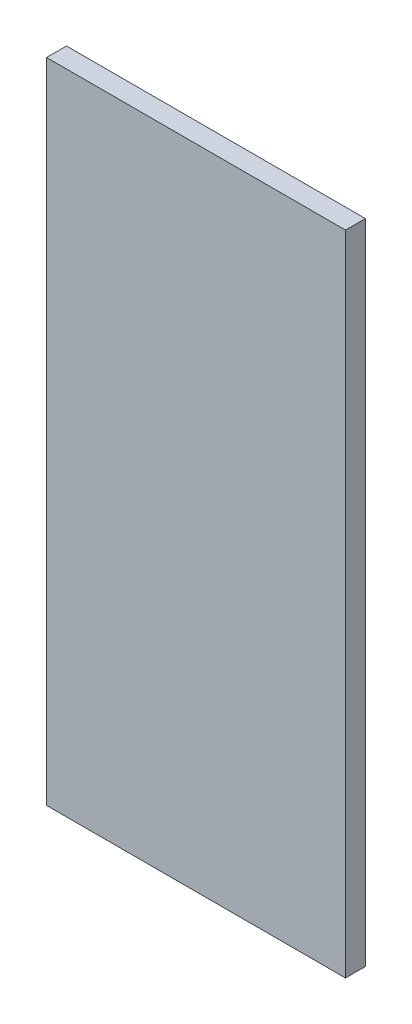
ISO-10303-21;
HEADER;
FILE_DESCRIPTION(('STEP AP214'),'2;1');
FILE_NAME('part.step','',(''),(''),'','','');
FILE_SCHEMA(('AUTOMOTIVE_DESIGN { 1 0 10303 214 1 1 1 1 }'));
ENDSEC;
DATA;
#1=APPLICATION_CONTEXT('core data for automotive mechanical design processes');
#2=APPLICATION_PROTOCOL_DEFINITION('international standard','automotive_design',2000,#1);
#3=PRODUCT_CONTEXT('',#1,'mechanical');
#4=PRODUCT('Part','Part','',(#3));
#5=PRODUCT_RELATED_PRODUCT_CATEGORY('part','',(#4));
#6=PRODUCT_DEFINITION_FORMATION('','',#4);
#7=PRODUCT_DEFINITION_CONTEXT('part definition',#1,'design');
#8=PRODUCT_DEFINITION('design','',#6,#7);
#9=PRODUCT_DEFINITION_SHAPE('','',#8);
#10=(LENGTH_UNIT() NAMED_UNIT(*) SI_UNIT(.MILLI.,.METRE.));
#11=(NAMED_UNIT(*) PLANE_ANGLE_UNIT() SI_UNIT($,.RADIAN.));
#12=(NAMED_UNIT(*) SI_UNIT($,.STERADIAN.) SOLID_ANGLE_UNIT());
#13=UNCERTAINTY_MEASURE_WITH_UNIT(LENGTH_MEASURE(1.E-05),#10,'distance_accuracy_value','');
#14=(GEOMETRIC_REPRESENTATION_CONTEXT(3) GLOBAL_UNCERTAINTY_ASSIGNED_CONTEXT((#13)) GLOBAL_UNIT_ASSIGNED_CONTEXT((#10,
#11,#12)) REPRESENTATION_CONTEXT('',''));
#15=CARTESIAN_POINT('',(0.,0.,0.));
#16=DIRECTION('',(0.,0.,1.));
#17=DIRECTION('',(1.,0.,0.));
#18=AXIS2_PLACEMENT_3D('',#15,#16,#17);
#19=CARTESIAN_POINT('',(0.762,-1.651,0.1016));
#20=DIRECTION('',(0.,0.,1.));
#21=DIRECTION('',(1.,0.,0.));
#22=AXIS2_PLACEMENT_3D('',#19,#20,#21);
#23=PLANE('',#22);
#24=DIRECTION('',(0.,1.,0.));
#25=VECTOR('',#24,1.);
#26=CARTESIAN_POINT('',(-0.762,-1.651,0.1016));
#27=LINE('',#26,#25);
#28=CARTESIAN_POINT('',(-0.762,-1.651,0.1016));
#29=VERTEX_POINT('',#28);
#30=CARTESIAN_POINT('',(-0.762,1.651,0.1016));
#31=VERTEX_POINT('',#30);
#32=EDGE_CURVE('E53',#29,#31,#27,.T.);
#33=ORIENTED_EDGE('',*,*,#32,.F.);
#34=DIRECTION('',(1.,0.,0.));
#35=VECTOR('',#34,1.);
#36=CARTESIAN_POINT('',(0.762,-1.651,0.1016));
#37=LINE('',#36,#35);
#38=CARTESIAN_POINT('',(0.762,-1.651,0.1016));
#39=VERTEX_POINT('',#38);
#40=EDGE_CURVE('E20',#29,#39,#37,.T.);
#41=ORIENTED_EDGE('',*,*,#40,.T.);
#42=DIRECTION('',(0.,1.,0.));
#43=VECTOR('',#42,1.);
#44=CARTESIAN_POINT('',(0.762,1.651,0.1016));
#45=LINE('',#44,#43);
#46=CARTESIAN_POINT('',(0.762,1.651,0.1016));
#47=VERTEX_POINT('',#46);
#48=EDGE_CURVE('E67',#47,#39,#45,.F.);
#49=ORIENTED_EDGE('',*,*,#48,.F.);
#50=DIRECTION('',(1.,0.,0.));
#51=VECTOR('',#50,1.);
#52=CARTESIAN_POINT('',(-0.762,1.651,0.1016));
#53=LINE('',#52,#51);
#54=EDGE_CURVE('E58',#31,#47,#53,.T.);
#55=ORIENTED_EDGE('',*,*,#54,.F.);
#56=EDGE_LOOP('',(#33,#41,#49,#55));
#57=FACE_BOUND('',#56,.T.);
#58=ADVANCED_FACE('F17',(#57),#23,.T.);
#59=CARTESIAN_POINT('',(0.762,1.651,0.));
#60=DIRECTION('',(1.,0.,0.));
#61=DIRECTION('',(0.,0.,-1.));
#62=AXIS2_PLACEMENT_3D('',#59,#60,#61);
#63=PLANE('',#62);
#64=DIRECTION('',(0.,0.,-1.));
#65=VECTOR('',#64,1.);
#66=CARTESIAN_POINT('',(0.762,-1.651,0.));
#67=LINE('',#66,#65);
#68=CARTESIAN_POINT('',(0.762,-1.651,0.));
#69=VERTEX_POINT('',#68);
#70=EDGE_CURVE('E80',#69,#39,#67,.F.);
#71=ORIENTED_EDGE('',*,*,#70,.F.);
#72=DIRECTION('',(0.,1.,0.));
#73=VECTOR('',#72,1.);
#74=CARTESIAN_POINT('',(0.762,-1.651,0.));
#75=LINE('',#74,#73);
#76=CARTESIAN_POINT('',(0.762,1.651,0.));
#77=VERTEX_POINT('',#76);
#78=EDGE_CURVE('E75',#69,#77,#75,.T.);
#79=ORIENTED_EDGE('',*,*,#78,.T.);
#80=DIRECTION('',(0.,0.,1.));
#81=VECTOR('',#80,1.);
#82=CARTESIAN_POINT('',(0.762,1.651,0.));
#83=LINE('',#82,#81);
#84=EDGE_CURVE('E63',#47,#77,#83,.F.);
#85=ORIENTED_EDGE('',*,*,#84,.F.);
#86=ORIENTED_EDGE('',*,*,#48,.T.);
#87=EDGE_LOOP('',(#71,#79,#85,#86));
#88=FACE_BOUND('',#87,.T.);
#89=ADVANCED_FACE('F74',(#88),#63,.T.);
#90=CARTESIAN_POINT('',(-0.762,1.651,0.));
#91=DIRECTION('',(0.,1.,0.));
#92=DIRECTION('',(0.,0.,1.));
#93=AXIS2_PLACEMENT_3D('',#90,#91,#92);
#94=PLANE('',#93);
#95=ORIENTED_EDGE('',*,*,#84,.T.);
#96=DIRECTION('',(1.,0.,0.));
#97=VECTOR('',#96,1.);
#98=CARTESIAN_POINT('',(0.762,1.651,0.));
#99=LINE('',#98,#97);
#100=CARTESIAN_POINT('',(-0.762,1.651,0.));
#101=VERTEX_POINT('',#100);
#102=EDGE_CURVE('E84',#77,#101,#99,.F.);
#103=ORIENTED_EDGE('',*,*,#102,.T.);
#104=DIRECTION('',(0.,0.,1.));
#105=VECTOR('',#104,1.);
#106=CARTESIAN_POINT('',(-0.762,1.651,0.));
#107=LINE('',#106,#105);
#108=EDGE_CURVE('E65',#31,#101,#107,.F.);
#109=ORIENTED_EDGE('',*,*,#108,.F.);
#110=ORIENTED_EDGE('',*,*,#54,.T.);
#111=EDGE_LOOP('',(#95,#103,#109,#110));
#112=FACE_BOUND('',#111,.T.);
#113=ADVANCED_FACE('F60',(#112),#94,.T.);
#114=CARTESIAN_POINT('',(-0.762,-1.651,0.));
#115=DIRECTION('',(-1.,0.,0.));
#116=DIRECTION('',(0.,0.,1.));
#117=AXIS2_PLACEMENT_3D('',#114,#115,#116);
#118=PLANE('',#117);
#119=ORIENTED_EDGE('',*,*,#108,.T.);
#120=DIRECTION('',(0.,1.,0.));
#121=VECTOR('',#120,1.);
#122=CARTESIAN_POINT('',(-0.762,-1.651,0.));
#123=LINE('',#122,#121);
#124=CARTESIAN_POINT('',(-0.762,-1.651,0.));
#125=VERTEX_POINT('',#124);
#126=EDGE_CURVE('E26',#101,#125,#123,.F.);
#127=ORIENTED_EDGE('',*,*,#126,.T.);
#128=DIRECTION('',(0.,0.,-1.));
#129=VECTOR('',#128,1.);
#130=CARTESIAN_POINT('',(-0.762,-1.651,0.));
#131=LINE('',#130,#129);
#132=EDGE_CURVE('E34',#29,#125,#131,.T.);
#133=ORIENTED_EDGE('',*,*,#132,.F.);
#134=ORIENTED_EDGE('',*,*,#32,.T.);
#135=EDGE_LOOP('',(#119,#127,#133,#134));
#136=FACE_BOUND('',#135,.T.);
#137=ADVANCED_FACE('F88',(#136),#118,.T.);
#138=CARTESIAN_POINT('',(0.762,-1.651,0.));
#139=DIRECTION('',(0.,-1.,0.));
#140=DIRECTION('',(0.,0.,-1.));
#141=AXIS2_PLACEMENT_3D('',#138,#139,#140);
#142=PLANE('',#141);
#143=ORIENTED_EDGE('',*,*,#132,.T.);
#144=DIRECTION('',(1.,0.,0.));
#145=VECTOR('',#144,1.);
#146=CARTESIAN_POINT('',(0.762,-1.651,0.));
#147=LINE('',#146,#145);
#148=EDGE_CURVE('E11',#125,#69,#147,.T.);
#149=ORIENTED_EDGE('',*,*,#148,.T.);
#150=ORIENTED_EDGE('',*,*,#70,.T.);
#151=ORIENTED_EDGE('',*,*,#40,.F.);
#152=EDGE_LOOP('',(#143,#149,#150,#151));
#153=FACE_BOUND('',#152,.T.);
#154=ADVANCED_FACE('F91',(#153),#142,.T.);
#155=CARTESIAN_POINT('',(0.762,-1.651,0.));
#156=DIRECTION('',(0.,0.,1.));
#157=DIRECTION('',(1.,0.,0.));
#158=AXIS2_PLACEMENT_3D('',#155,#156,#157);
#159=PLANE('',#158);
#160=ORIENTED_EDGE('',*,*,#126,.F.);
#161=ORIENTED_EDGE('',*,*,#102,.F.);
#162=ORIENTED_EDGE('',*,*,#78,.F.);
#163=ORIENTED_EDGE('',*,*,#148,.F.);
#164=EDGE_LOOP('',(#160,#161,#162,#163));
#165=FACE_BOUND('',#164,.T.);
#166=ADVANCED_FACE('F90',(#165),#159,.F.);
#167=CLOSED_SHELL('',(#58,#89,#113,#137,#154,#166));
#168=MANIFOLD_SOLID_BREP('B1',#167);
#169=ADVANCED_BREP_SHAPE_REPRESENTATION('',(#18,#168),#14);
#170=SHAPE_DEFINITION_REPRESENTATION(#9,#169);
ENDSEC;
END-ISO-10303-21;
